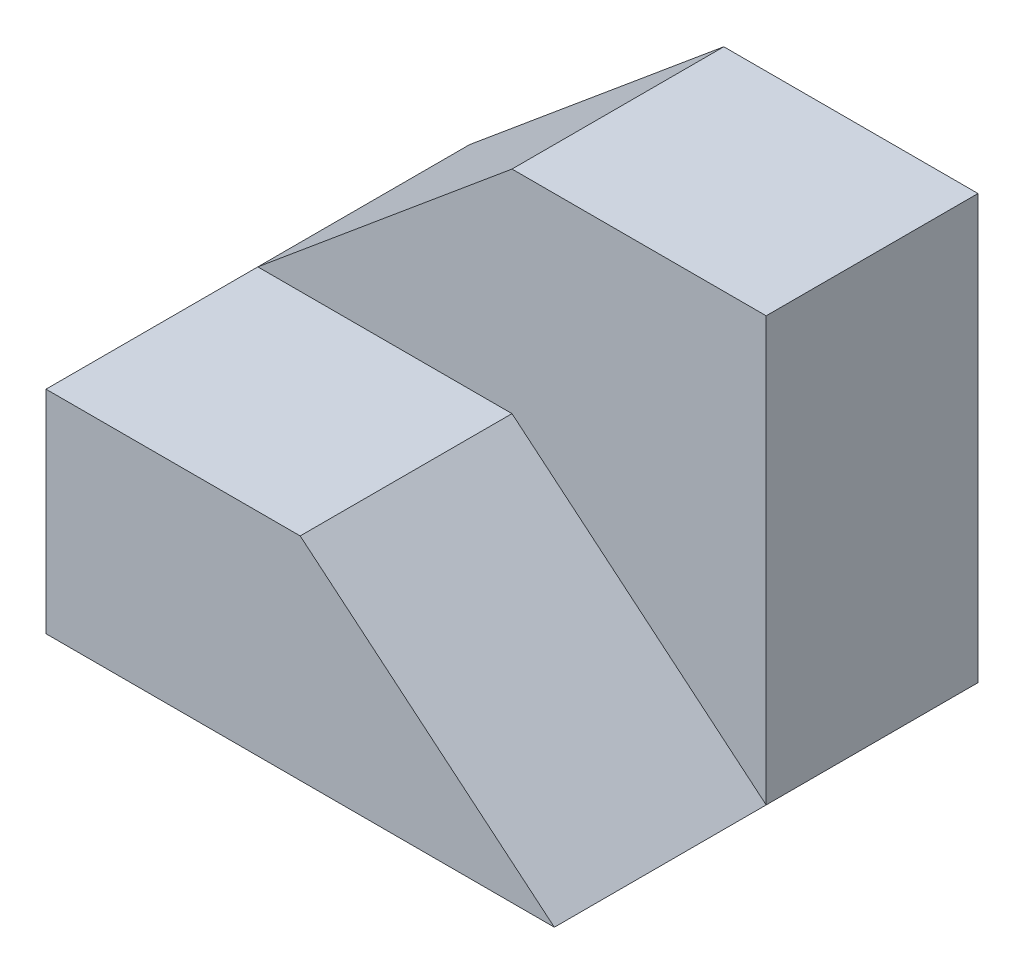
from build123d import *

# Parameters (mm, degrees)
EXTRUDE_1_DEPTH = 100
EXTRUDE_2_DEPTH = 50


with BuildPart() as part:
    # Sketch 1 → Extrude 1 (new body)
    with BuildSketch(Plane.XY):
        Polygon((-60, 0), (60, 0), (0, 50), (-60, 50), align=None)
    extrude(amount=-EXTRUDE_1_DEPTH)

    # Sketch 2 → Extrude 2 (add)
    with BuildSketch(Plane(origin=(0, 0, -100), x_dir=(-1, 0, 0), z_dir=(0, 0, -1))):
        Polygon((-60, 0), (-60, 100), (0, 100), (60, 50), (0, 50), align=None)
    extrude(amount=-EXTRUDE_2_DEPTH)


solid = part.part
